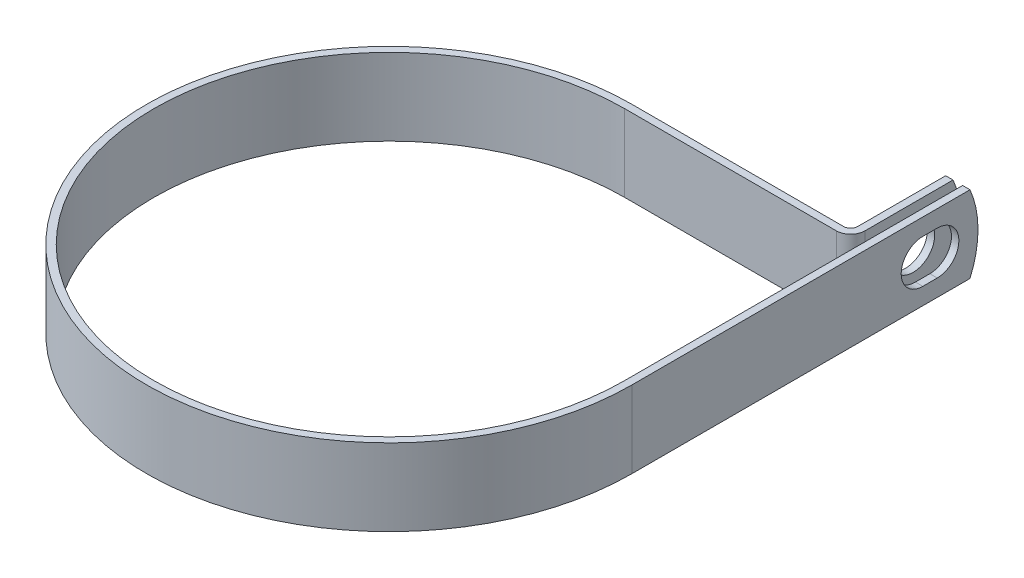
ISO-10303-21;
HEADER;
FILE_DESCRIPTION(('STEP AP214'),'2;1');
FILE_NAME('part.step','',(''),(''),'','','');
FILE_SCHEMA(('AUTOMOTIVE_DESIGN { 1 0 10303 214 1 1 1 1 }'));
ENDSEC;
DATA;
#1=APPLICATION_CONTEXT('core data for automotive mechanical design processes');
#2=APPLICATION_PROTOCOL_DEFINITION('international standard','automotive_design',2000,#1);
#3=PRODUCT_CONTEXT('',#1,'mechanical');
#4=PRODUCT('Part','Part','',(#3));
#5=PRODUCT_RELATED_PRODUCT_CATEGORY('part','',(#4));
#6=PRODUCT_DEFINITION_FORMATION('','',#4);
#7=PRODUCT_DEFINITION_CONTEXT('part definition',#1,'design');
#8=PRODUCT_DEFINITION('design','',#6,#7);
#9=PRODUCT_DEFINITION_SHAPE('','',#8);
#10=(LENGTH_UNIT() NAMED_UNIT(*) SI_UNIT(.MILLI.,.METRE.));
#11=(NAMED_UNIT(*) PLANE_ANGLE_UNIT() SI_UNIT($,.RADIAN.));
#12=(NAMED_UNIT(*) SI_UNIT($,.STERADIAN.) SOLID_ANGLE_UNIT());
#13=UNCERTAINTY_MEASURE_WITH_UNIT(LENGTH_MEASURE(1.E-05),#10,'distance_accuracy_value','');
#14=(GEOMETRIC_REPRESENTATION_CONTEXT(3) GLOBAL_UNCERTAINTY_ASSIGNED_CONTEXT((#13)) GLOBAL_UNIT_ASSIGNED_CONTEXT((#10,
#11,#12)) REPRESENTATION_CONTEXT('',''));
#15=CARTESIAN_POINT('',(0.,0.,0.));
#16=DIRECTION('',(0.,0.,1.));
#17=DIRECTION('',(1.,0.,0.));
#18=AXIS2_PLACEMENT_3D('',#15,#16,#17);
#19=CARTESIAN_POINT('',(38.8874,6.35,0.));
#20=DIRECTION('',(-1.,0.,0.));
#21=DIRECTION('',(0.,0.,1.));
#22=AXIS2_PLACEMENT_3D('',#19,#20,#21);
#23=PLANE('',#22);
#24=DIRECTION('',(0.,0.,-1.));
#25=VECTOR('',#24,1.);
#26=CARTESIAN_POINT('',(38.8874,-3.5687,-48.0059999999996));
#27=LINE('',#26,#25);
#28=CARTESIAN_POINT('',(38.8874,-3.5687,-48.0059999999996));
#29=VERTEX_POINT('',#28);
#30=CARTESIAN_POINT('',(38.8874,-3.5687,-50.3936000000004));
#31=VERTEX_POINT('',#30);
#32=EDGE_CURVE('E236',#29,#31,#27,.T.);
#33=ORIENTED_EDGE('',*,*,#32,.T.);
#34=CARTESIAN_POINT('',(38.8874,0.,-50.3935999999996));
#35=DIRECTION('',(-1.,0.,0.));
#36=DIRECTION('',(0.,0.,1.));
#37=AXIS2_PLACEMENT_3D('',#34,#35,#36);
#38=CIRCLE('',#37,3.5687);
#39=CARTESIAN_POINT('',(38.8874,3.5687,-50.3936000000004));
#40=VERTEX_POINT('',#39);
#41=EDGE_CURVE('E257',#31,#40,#38,.F.);
#42=ORIENTED_EDGE('',*,*,#41,.T.);
#43=DIRECTION('',(0.,0.,1.));
#44=VECTOR('',#43,1.);
#45=CARTESIAN_POINT('',(38.8874,3.5687,-48.0059999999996));
#46=LINE('',#45,#44);
#47=CARTESIAN_POINT('',(38.8874,3.5687,-48.0059999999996));
#48=VERTEX_POINT('',#47);
#49=EDGE_CURVE('E253',#40,#48,#46,.T.);
#50=ORIENTED_EDGE('',*,*,#49,.T.);
#51=CARTESIAN_POINT('',(38.8874,0.,-48.0059999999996));
#52=DIRECTION('',(-1.,0.,0.));
#53=DIRECTION('',(0.,0.,1.));
#54=AXIS2_PLACEMENT_3D('',#51,#52,#53);
#55=CIRCLE('',#54,3.5687);
#56=EDGE_CURVE('E248',#48,#29,#55,.F.);
#57=ORIENTED_EDGE('',*,*,#56,.T.);
#58=EDGE_LOOP('',(#33,#42,#50,#57));
#59=FACE_BOUND('',#58,.T.);
#60=CARTESIAN_POINT('',(38.8874,0.,-41.2496));
#61=DIRECTION('',(-1.,0.,0.));
#62=DIRECTION('',(0.,0.,1.));
#63=AXIS2_PLACEMENT_3D('',#60,#61,#62);
#64=CIRCLE('',#63,15.875);
#65=CARTESIAN_POINT('',(38.8874,6.35,-55.7992778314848));
#66=VERTEX_POINT('',#65);
#67=CARTESIAN_POINT('',(38.8874,-6.35,-55.7992778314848));
#68=VERTEX_POINT('',#67);
#69=EDGE_CURVE('E75',#66,#68,#64,.T.);
#70=ORIENTED_EDGE('',*,*,#69,.T.);
#71=DIRECTION('',(0.,0.,-1.));
#72=VECTOR('',#71,1.);
#73=CARTESIAN_POINT('',(38.8874,-6.35,0.));
#74=LINE('',#73,#72);
#75=CARTESIAN_POINT('',(38.8874,-6.35,0.));
#76=VERTEX_POINT('',#75);
#77=EDGE_CURVE('E271',#76,#68,#74,.T.);
#78=ORIENTED_EDGE('',*,*,#77,.F.);
#79=DIRECTION('',(0.,-1.,0.));
#80=VECTOR('',#79,1.);
#81=CARTESIAN_POINT('',(38.8874,6.35,0.));
#82=LINE('',#81,#80);
#83=CARTESIAN_POINT('',(38.8874,6.35,0.));
#84=VERTEX_POINT('',#83);
#85=EDGE_CURVE('E218',#84,#76,#82,.T.);
#86=ORIENTED_EDGE('',*,*,#85,.F.);
#87=DIRECTION('',(0.,0.,-1.));
#88=VECTOR('',#87,1.);
#89=CARTESIAN_POINT('',(38.8874,6.35,-38.8874));
#90=LINE('',#89,#88);
#91=EDGE_CURVE('E273',#84,#66,#90,.T.);
#92=ORIENTED_EDGE('',*,*,#91,.T.);
#93=EDGE_LOOP('',(#70,#78,#86,#92));
#94=FACE_BOUND('',#93,.T.);
#95=ADVANCED_FACE('F54',(#59,#94),#23,.T.);
#96=CARTESIAN_POINT('',(37.3126,6.35,-57.1246));
#97=DIRECTION('',(1.,0.,0.));
#98=DIRECTION('',(0.,0.,-1.));
#99=AXIS2_PLACEMENT_3D('',#96,#97,#98);
#100=PLANE('',#99);
#101=CARTESIAN_POINT('',(37.3126,0.,-49.1998));
#102=DIRECTION('',(1.,0.,0.));
#103=DIRECTION('',(0.,0.,-1.));
#104=AXIS2_PLACEMENT_3D('',#101,#102,#103);
#105=CIRCLE('',#104,3.5687);
#106=CARTESIAN_POINT('',(37.3126,0.,-52.7685));
#107=VERTEX_POINT('',#106);
#108=EDGE_CURVE('E268',#107,#107,#105,.F.);
#109=ORIENTED_EDGE('',*,*,#108,.T.);
#110=EDGE_LOOP('',(#109));
#111=FACE_BOUND('',#110,.T.);
#112=DIRECTION('',(0.,0.,1.));
#113=VECTOR('',#112,1.);
#114=CARTESIAN_POINT('',(37.3126,-6.35,-57.1246));
#115=LINE('',#114,#113);
#116=CARTESIAN_POINT('',(37.3126,-6.35,-55.7992778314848));
#117=VERTEX_POINT('',#116);
#118=CARTESIAN_POINT('',(37.3126,-6.35,-41.26484));
#119=VERTEX_POINT('',#118);
#120=EDGE_CURVE('E184',#117,#119,#115,.T.);
#121=ORIENTED_EDGE('',*,*,#120,.F.);
#122=CARTESIAN_POINT('',(37.3126,0.,-41.2496));
#123=DIRECTION('',(1.,0.,0.));
#124=DIRECTION('',(0.,0.,-1.));
#125=AXIS2_PLACEMENT_3D('',#122,#123,#124);
#126=CIRCLE('',#125,15.875);
#127=CARTESIAN_POINT('',(37.3126,6.35,-55.7992778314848));
#128=VERTEX_POINT('',#127);
#129=EDGE_CURVE('E176',#117,#128,#126,.T.);
#130=ORIENTED_EDGE('',*,*,#129,.T.);
#131=DIRECTION('',(0.,0.,1.));
#132=VECTOR('',#131,1.);
#133=CARTESIAN_POINT('',(37.3126,6.35,-57.1246));
#134=LINE('',#133,#132);
#135=CARTESIAN_POINT('',(37.3126,6.35,-41.26484));
#136=VERTEX_POINT('',#135);
#137=EDGE_CURVE('E224',#128,#136,#134,.T.);
#138=ORIENTED_EDGE('',*,*,#137,.T.);
#139=DIRECTION('',(0.,-1.,0.));
#140=VECTOR('',#139,1.);
#141=CARTESIAN_POINT('',(37.3126,6.35,-41.26484));
#142=LINE('',#141,#140);
#143=EDGE_CURVE('E211',#136,#119,#142,.T.);
#144=ORIENTED_EDGE('',*,*,#143,.T.);
#145=EDGE_LOOP('',(#121,#130,#138,#144));
#146=FACE_BOUND('',#145,.T.);
#147=ADVANCED_FACE('F226',(#111,#146),#100,.T.);
#148=CARTESIAN_POINT('',(36.0934,6.35,-57.1246));
#149=DIRECTION('',(1.,0.,0.));
#150=DIRECTION('',(0.,0.,-1.));
#151=AXIS2_PLACEMENT_3D('',#148,#149,#150);
#152=PLANE('',#151);
#153=CARTESIAN_POINT('',(36.0934,0.,-49.1998));
#154=DIRECTION('',(-1.,0.,0.));
#155=DIRECTION('',(0.,0.,1.));
#156=AXIS2_PLACEMENT_3D('',#153,#154,#155);
#157=CIRCLE('',#156,3.5687);
#158=CARTESIAN_POINT('',(36.0934,0.,-45.6311));
#159=VERTEX_POINT('',#158);
#160=EDGE_CURVE('E265',#159,#159,#157,.T.);
#161=ORIENTED_EDGE('',*,*,#160,.F.);
#162=EDGE_LOOP('',(#161));
#163=FACE_BOUND('',#162,.T.);
#164=CARTESIAN_POINT('',(36.0934,0.,-41.2496));
#165=DIRECTION('',(-1.,0.,0.));
#166=DIRECTION('',(0.,0.,1.));
#167=AXIS2_PLACEMENT_3D('',#164,#165,#166);
#168=CIRCLE('',#167,15.875);
#169=CARTESIAN_POINT('',(36.0934,6.35,-55.7992778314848));
#170=VERTEX_POINT('',#169);
#171=CARTESIAN_POINT('',(36.0934,-6.35,-55.7992778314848));
#172=VERTEX_POINT('',#171);
#173=EDGE_CURVE('E67',#170,#172,#168,.T.);
#174=ORIENTED_EDGE('',*,*,#173,.T.);
#175=DIRECTION('',(0.,0.,1.));
#176=VECTOR('',#175,1.);
#177=CARTESIAN_POINT('',(36.0934,-6.35,-57.1246));
#178=LINE('',#177,#176);
#179=CARTESIAN_POINT('',(36.0934,-6.35,-41.26484));
#180=VERTEX_POINT('',#179);
#181=EDGE_CURVE('E167',#172,#180,#178,.T.);
#182=ORIENTED_EDGE('',*,*,#181,.T.);
#183=DIRECTION('',(0.,-1.,0.));
#184=VECTOR('',#183,1.);
#185=CARTESIAN_POINT('',(36.0934,6.35,-41.26484));
#186=LINE('',#185,#184);
#187=CARTESIAN_POINT('',(36.0934,6.35,-41.26484));
#188=VERTEX_POINT('',#187);
#189=EDGE_CURVE('E209',#188,#180,#186,.T.);
#190=ORIENTED_EDGE('',*,*,#189,.F.);
#191=DIRECTION('',(0.,0.,1.));
#192=VECTOR('',#191,1.);
#193=CARTESIAN_POINT('',(36.0934,6.35,-57.1246));
#194=LINE('',#193,#192);
#195=EDGE_CURVE('E169',#170,#188,#194,.T.);
#196=ORIENTED_EDGE('',*,*,#195,.F.);
#197=EDGE_LOOP('',(#174,#182,#190,#196));
#198=FACE_BOUND('',#197,.T.);
#199=ADVANCED_FACE('F164',(#163,#198),#152,.F.);
#200=CARTESIAN_POINT('',(40.1066,6.35,0.));
#201=DIRECTION('',(-1.,0.,0.));
#202=DIRECTION('',(0.,0.,1.));
#203=AXIS2_PLACEMENT_3D('',#200,#201,#202);
#204=PLANE('',#203);
#205=CARTESIAN_POINT('',(40.1066,0.,-50.3935999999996));
#206=DIRECTION('',(1.,0.,0.));
#207=DIRECTION('',(0.,0.,-1.));
#208=AXIS2_PLACEMENT_3D('',#205,#206,#207);
#209=CIRCLE('',#208,3.5687);
#210=CARTESIAN_POINT('',(40.1066,-3.5687,-50.3936000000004));
#211=VERTEX_POINT('',#210);
#212=CARTESIAN_POINT('',(40.1066,3.5687,-50.3936000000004));
#213=VERTEX_POINT('',#212);
#214=EDGE_CURVE('E237',#211,#213,#209,.T.);
#215=ORIENTED_EDGE('',*,*,#214,.F.);
#216=DIRECTION('',(0.,0.,-1.));
#217=VECTOR('',#216,1.);
#218=CARTESIAN_POINT('',(40.1066,-3.5687,-48.0059999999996));
#219=LINE('',#218,#217);
#220=CARTESIAN_POINT('',(40.1066,-3.5687,-48.0059999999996));
#221=VERTEX_POINT('',#220);
#222=EDGE_CURVE('E240',#221,#211,#219,.T.);
#223=ORIENTED_EDGE('',*,*,#222,.F.);
#224=CARTESIAN_POINT('',(40.1066,0.,-48.0059999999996));
#225=DIRECTION('',(1.,0.,0.));
#226=DIRECTION('',(0.,0.,-1.));
#227=AXIS2_PLACEMENT_3D('',#224,#225,#226);
#228=CIRCLE('',#227,3.5687);
#229=CARTESIAN_POINT('',(40.1066,3.5687,-48.0059999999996));
#230=VERTEX_POINT('',#229);
#231=EDGE_CURVE('E230',#230,#221,#228,.T.);
#232=ORIENTED_EDGE('',*,*,#231,.F.);
#233=DIRECTION('',(0.,0.,1.));
#234=VECTOR('',#233,1.);
#235=CARTESIAN_POINT('',(40.1066,3.5687,-48.0059999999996));
#236=LINE('',#235,#234);
#237=EDGE_CURVE('E234',#213,#230,#236,.T.);
#238=ORIENTED_EDGE('',*,*,#237,.F.);
#239=EDGE_LOOP('',(#215,#223,#232,#238));
#240=FACE_BOUND('',#239,.T.);
#241=DIRECTION('',(0.,0.,-1.));
#242=VECTOR('',#241,1.);
#243=CARTESIAN_POINT('',(40.1066,-6.35,0.));
#244=LINE('',#243,#242);
#245=CARTESIAN_POINT('',(40.1066,-6.35,0.));
#246=VERTEX_POINT('',#245);
#247=CARTESIAN_POINT('',(40.1066,-6.35,-55.7992778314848));
#248=VERTEX_POINT('',#247);
#249=EDGE_CURVE('E195',#246,#248,#244,.T.);
#250=ORIENTED_EDGE('',*,*,#249,.T.);
#251=CARTESIAN_POINT('',(40.1066,0.,-41.2496));
#252=DIRECTION('',(-1.,0.,0.));
#253=DIRECTION('',(0.,0.,1.));
#254=AXIS2_PLACEMENT_3D('',#251,#252,#253);
#255=CIRCLE('',#254,15.875);
#256=CARTESIAN_POINT('',(40.1066,6.35,-55.7992778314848));
#257=VERTEX_POINT('',#256);
#258=EDGE_CURVE('E170',#257,#248,#255,.T.);
#259=ORIENTED_EDGE('',*,*,#258,.F.);
#260=DIRECTION('',(0.,0.,-1.));
#261=VECTOR('',#260,1.);
#262=CARTESIAN_POINT('',(40.1066,6.35,-38.8874));
#263=LINE('',#262,#261);
#264=CARTESIAN_POINT('',(40.1066,6.35,0.));
#265=VERTEX_POINT('',#264);
#266=EDGE_CURVE('E198',#265,#257,#263,.T.);
#267=ORIENTED_EDGE('',*,*,#266,.F.);
#268=DIRECTION('',(0.,-1.,0.));
#269=VECTOR('',#268,1.);
#270=CARTESIAN_POINT('',(40.1066,6.35,0.));
#271=LINE('',#270,#269);
#272=EDGE_CURVE('E199',#265,#246,#271,.T.);
#273=ORIENTED_EDGE('',*,*,#272,.T.);
#274=EDGE_LOOP('',(#250,#259,#267,#273));
#275=FACE_BOUND('',#274,.T.);
#276=ADVANCED_FACE('F321',(#240,#275),#204,.F.);
#277=CARTESIAN_POINT('',(0.,-6.35,0.));
#278=DIRECTION('',(0.,1.,0.));
#279=DIRECTION('',(1.,0.,0.));
#280=AXIS2_PLACEMENT_3D('',#277,#278,#279);
#281=PLANE('',#280);
#282=DIRECTION('',(-1.,0.,0.));
#283=VECTOR('',#282,1.);
#284=CARTESIAN_POINT('',(40.1066,-6.35,-55.7992778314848));
#285=LINE('',#284,#283);
#286=EDGE_CURVE('E171',#248,#68,#285,.T.);
#287=ORIENTED_EDGE('',*,*,#286,.F.);
#288=ORIENTED_EDGE('',*,*,#249,.F.);
#289=CARTESIAN_POINT('',(0.,-6.35,0.));
#290=DIRECTION('',(0.,1.,0.));
#291=DIRECTION('',(1.,0.,0.));
#292=AXIS2_PLACEMENT_3D('',#289,#290,#291);
#293=CIRCLE('',#292,40.1066);
#294=CARTESIAN_POINT('',(0.,-6.35,-40.1066));
#295=VERTEX_POINT('',#294);
#296=EDGE_CURVE('E193',#295,#246,#293,.T.);
#297=ORIENTED_EDGE('',*,*,#296,.F.);
#298=DIRECTION('',(1.,0.,0.));
#299=VECTOR('',#298,1.);
#300=CARTESIAN_POINT('',(0.,-6.35,-40.1066));
#301=LINE('',#300,#299);
#302=CARTESIAN_POINT('',(34.93516,-6.35,-40.1066));
#303=VERTEX_POINT('',#302);
#304=EDGE_CURVE('E186',#303,#295,#301,.F.);
#305=ORIENTED_EDGE('',*,*,#304,.F.);
#306=CARTESIAN_POINT('',(34.93516,-6.35,-41.26484));
#307=DIRECTION('',(0.,1.,0.));
#308=DIRECTION('',(1.,0.,0.));
#309=AXIS2_PLACEMENT_3D('',#306,#307,#308);
#310=CIRCLE('',#309,1.15824000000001);
#311=EDGE_CURVE('E183',#180,#303,#310,.F.);
#312=ORIENTED_EDGE('',*,*,#311,.F.);
#313=ORIENTED_EDGE('',*,*,#181,.F.);
#314=DIRECTION('',(-1.,0.,0.));
#315=VECTOR('',#314,1.);
#316=CARTESIAN_POINT('',(40.1066,-6.35,-55.7992778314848));
#317=LINE('',#316,#315);
#318=EDGE_CURVE('E12',#117,#172,#317,.T.);
#319=ORIENTED_EDGE('',*,*,#318,.F.);
#320=ORIENTED_EDGE('',*,*,#120,.T.);
#321=CARTESIAN_POINT('',(34.93516,-6.35,-41.26484));
#322=DIRECTION('',(0.,-1.,0.));
#323=DIRECTION('',(0.,0.,1.));
#324=AXIS2_PLACEMENT_3D('',#321,#322,#323);
#325=CIRCLE('',#324,2.37744);
#326=CARTESIAN_POINT('',(34.93516,-6.35,-38.8874));
#327=VERTEX_POINT('',#326);
#328=EDGE_CURVE('E188',#119,#327,#325,.T.);
#329=ORIENTED_EDGE('',*,*,#328,.T.);
#330=DIRECTION('',(-1.,0.,0.));
#331=VECTOR('',#330,1.);
#332=CARTESIAN_POINT('',(0.,-6.35,-38.8874));
#333=LINE('',#332,#331);
#334=CARTESIAN_POINT('',(0.,-6.35,-38.8874));
#335=VERTEX_POINT('',#334);
#336=EDGE_CURVE('E298',#327,#335,#333,.T.);
#337=ORIENTED_EDGE('',*,*,#336,.T.);
#338=CARTESIAN_POINT('',(0.,-6.35,0.));
#339=DIRECTION('',(0.,1.,0.));
#340=DIRECTION('',(0.,0.,1.));
#341=AXIS2_PLACEMENT_3D('',#338,#339,#340);
#342=CIRCLE('',#341,38.8874);
#343=EDGE_CURVE('E295',#335,#76,#342,.T.);
#344=ORIENTED_EDGE('',*,*,#343,.T.);
#345=ORIENTED_EDGE('',*,*,#77,.T.);
#346=EDGE_LOOP('',(#287,#288,#297,#305,#312,#313,#319,#320,#329,#337,#344,#345));
#347=FACE_BOUND('',#346,.T.);
#348=ADVANCED_FACE('F181',(#347),#281,.F.);
#349=CARTESIAN_POINT('',(0.,6.35,0.));
#350=DIRECTION('',(0.,1.,0.));
#351=DIRECTION('',(1.,0.,0.));
#352=AXIS2_PLACEMENT_3D('',#349,#350,#351);
#353=PLANE('',#352);
#354=ORIENTED_EDGE('',*,*,#266,.T.);
#355=DIRECTION('',(-1.,0.,0.));
#356=VECTOR('',#355,1.);
#357=CARTESIAN_POINT('',(40.1066,6.35,-55.7992778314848));
#358=LINE('',#357,#356);
#359=EDGE_CURVE('E228',#257,#66,#358,.T.);
#360=ORIENTED_EDGE('',*,*,#359,.T.);
#361=ORIENTED_EDGE('',*,*,#91,.F.);
#362=CARTESIAN_POINT('',(0.,6.35,0.));
#363=DIRECTION('',(0.,1.,0.));
#364=DIRECTION('',(0.,0.,1.));
#365=AXIS2_PLACEMENT_3D('',#362,#363,#364);
#366=CIRCLE('',#365,38.8874);
#367=CARTESIAN_POINT('',(0.,6.35,-38.8874));
#368=VERTEX_POINT('',#367);
#369=EDGE_CURVE('E276',#368,#84,#366,.T.);
#370=ORIENTED_EDGE('',*,*,#369,.F.);
#371=DIRECTION('',(-1.,0.,0.));
#372=VECTOR('',#371,1.);
#373=CARTESIAN_POINT('',(0.,6.35,-38.8874));
#374=LINE('',#373,#372);
#375=CARTESIAN_POINT('',(34.93516,6.35,-38.8874));
#376=VERTEX_POINT('',#375);
#377=EDGE_CURVE('E279',#376,#368,#374,.T.);
#378=ORIENTED_EDGE('',*,*,#377,.F.);
#379=CARTESIAN_POINT('',(34.93516,6.35,-41.26484));
#380=DIRECTION('',(0.,-1.,0.));
#381=DIRECTION('',(0.,0.,1.));
#382=AXIS2_PLACEMENT_3D('',#379,#380,#381);
#383=CIRCLE('',#382,2.37744);
#384=EDGE_CURVE('E282',#136,#376,#383,.T.);
#385=ORIENTED_EDGE('',*,*,#384,.F.);
#386=ORIENTED_EDGE('',*,*,#137,.F.);
#387=DIRECTION('',(-1.,0.,0.));
#388=VECTOR('',#387,1.);
#389=CARTESIAN_POINT('',(40.1066,6.35,-55.7992778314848));
#390=LINE('',#389,#388);
#391=EDGE_CURVE('E61',#128,#170,#390,.T.);
#392=ORIENTED_EDGE('',*,*,#391,.T.);
#393=ORIENTED_EDGE('',*,*,#195,.T.);
#394=CARTESIAN_POINT('',(34.93516,6.35,-41.26484));
#395=DIRECTION('',(0.,1.,0.));
#396=DIRECTION('',(1.,0.,0.));
#397=AXIS2_PLACEMENT_3D('',#394,#395,#396);
#398=CIRCLE('',#397,1.15824000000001);
#399=CARTESIAN_POINT('',(34.93516,6.35,-40.1066));
#400=VERTEX_POINT('',#399);
#401=EDGE_CURVE('E287',#188,#400,#398,.F.);
#402=ORIENTED_EDGE('',*,*,#401,.T.);
#403=DIRECTION('',(1.,0.,0.));
#404=VECTOR('',#403,1.);
#405=CARTESIAN_POINT('',(0.,6.35,-40.1066));
#406=LINE('',#405,#404);
#407=CARTESIAN_POINT('',(0.,6.35,-40.1066));
#408=VERTEX_POINT('',#407);
#409=EDGE_CURVE('E289',#400,#408,#406,.F.);
#410=ORIENTED_EDGE('',*,*,#409,.T.);
#411=CARTESIAN_POINT('',(0.,6.35,0.));
#412=DIRECTION('',(0.,1.,0.));
#413=DIRECTION('',(1.,0.,0.));
#414=AXIS2_PLACEMENT_3D('',#411,#412,#413);
#415=CIRCLE('',#414,40.1066);
#416=EDGE_CURVE('E203',#408,#265,#415,.T.);
#417=ORIENTED_EDGE('',*,*,#416,.T.);
#418=EDGE_LOOP('',(#354,#360,#361,#370,#378,#385,#386,#392,#393,#402,#410,#417));
#419=FACE_BOUND('',#418,.T.);
#420=ADVANCED_FACE('F222',(#419),#353,.T.);
#421=CARTESIAN_POINT('',(0.,6.35,0.));
#422=DIRECTION('',(0.,-1.,0.));
#423=DIRECTION('',(0.,0.,-1.));
#424=AXIS2_PLACEMENT_3D('',#421,#422,#423);
#425=CYLINDRICAL_SURFACE('',#424,38.8874);
#426=ORIENTED_EDGE('',*,*,#343,.F.);
#427=DIRECTION('',(0.,-1.,0.));
#428=VECTOR('',#427,1.);
#429=CARTESIAN_POINT('',(0.,6.35,-38.8874));
#430=LINE('',#429,#428);
#431=EDGE_CURVE('E216',#368,#335,#430,.T.);
#432=ORIENTED_EDGE('',*,*,#431,.F.);
#433=ORIENTED_EDGE('',*,*,#369,.T.);
#434=ORIENTED_EDGE('',*,*,#85,.T.);
#435=EDGE_LOOP('',(#426,#432,#433,#434));
#436=FACE_BOUND('',#435,.T.);
#437=ADVANCED_FACE('F311',(#436),#425,.F.);
#438=CARTESIAN_POINT('',(0.,6.35,-38.8874));
#439=DIRECTION('',(0.,0.,1.));
#440=DIRECTION('',(1.,0.,0.));
#441=AXIS2_PLACEMENT_3D('',#438,#439,#440);
#442=PLANE('',#441);
#443=ORIENTED_EDGE('',*,*,#336,.F.);
#444=DIRECTION('',(0.,-1.,0.));
#445=VECTOR('',#444,1.);
#446=CARTESIAN_POINT('',(34.93516,6.35,-38.8874));
#447=LINE('',#446,#445);
#448=EDGE_CURVE('E214',#376,#327,#447,.T.);
#449=ORIENTED_EDGE('',*,*,#448,.F.);
#450=ORIENTED_EDGE('',*,*,#377,.T.);
#451=ORIENTED_EDGE('',*,*,#431,.T.);
#452=EDGE_LOOP('',(#443,#449,#450,#451));
#453=FACE_BOUND('',#452,.T.);
#454=ADVANCED_FACE('F307',(#453),#442,.T.);
#455=CARTESIAN_POINT('',(34.93516,6.35,-41.26484));
#456=DIRECTION('',(0.,-1.,0.));
#457=DIRECTION('',(0.,0.,-1.));
#458=AXIS2_PLACEMENT_3D('',#455,#456,#457);
#459=CYLINDRICAL_SURFACE('',#458,2.37744);
#460=ORIENTED_EDGE('',*,*,#328,.F.);
#461=ORIENTED_EDGE('',*,*,#143,.F.);
#462=ORIENTED_EDGE('',*,*,#384,.T.);
#463=ORIENTED_EDGE('',*,*,#448,.T.);
#464=EDGE_LOOP('',(#460,#461,#462,#463));
#465=FACE_BOUND('',#464,.T.);
#466=ADVANCED_FACE('F304',(#465),#459,.T.);
#467=CARTESIAN_POINT('',(34.93516,6.35,-41.26484));
#468=DIRECTION('',(0.,-1.,0.));
#469=DIRECTION('',(0.,0.,-1.));
#470=AXIS2_PLACEMENT_3D('',#467,#468,#469);
#471=CYLINDRICAL_SURFACE('',#470,1.15824000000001);
#472=ORIENTED_EDGE('',*,*,#311,.T.);
#473=DIRECTION('',(0.,-1.,0.));
#474=VECTOR('',#473,1.);
#475=CARTESIAN_POINT('',(34.93516,6.35,-40.1066));
#476=LINE('',#475,#474);
#477=EDGE_CURVE('E206',#400,#303,#476,.T.);
#478=ORIENTED_EDGE('',*,*,#477,.F.);
#479=ORIENTED_EDGE('',*,*,#401,.F.);
#480=ORIENTED_EDGE('',*,*,#189,.T.);
#481=EDGE_LOOP('',(#472,#478,#479,#480));
#482=FACE_BOUND('',#481,.T.);
#483=ADVANCED_FACE('F334',(#482),#471,.F.);
#484=CARTESIAN_POINT('',(0.,6.35,-40.1066));
#485=DIRECTION('',(0.,0.,1.));
#486=DIRECTION('',(1.,0.,0.));
#487=AXIS2_PLACEMENT_3D('',#484,#485,#486);
#488=PLANE('',#487);
#489=ORIENTED_EDGE('',*,*,#304,.T.);
#490=DIRECTION('',(0.,-1.,0.));
#491=VECTOR('',#490,1.);
#492=CARTESIAN_POINT('',(0.,6.35,-40.1066));
#493=LINE('',#492,#491);
#494=EDGE_CURVE('E202',#408,#295,#493,.T.);
#495=ORIENTED_EDGE('',*,*,#494,.F.);
#496=ORIENTED_EDGE('',*,*,#409,.F.);
#497=ORIENTED_EDGE('',*,*,#477,.T.);
#498=EDGE_LOOP('',(#489,#495,#496,#497));
#499=FACE_BOUND('',#498,.T.);
#500=ADVANCED_FACE('F330',(#499),#488,.F.);
#501=CARTESIAN_POINT('',(0.,6.35,0.));
#502=DIRECTION('',(0.,-1.,0.));
#503=DIRECTION('',(0.,0.,-1.));
#504=AXIS2_PLACEMENT_3D('',#501,#502,#503);
#505=CYLINDRICAL_SURFACE('',#504,40.1066);
#506=ORIENTED_EDGE('',*,*,#296,.T.);
#507=ORIENTED_EDGE('',*,*,#272,.F.);
#508=ORIENTED_EDGE('',*,*,#416,.F.);
#509=ORIENTED_EDGE('',*,*,#494,.T.);
#510=EDGE_LOOP('',(#506,#507,#508,#509));
#511=FACE_BOUND('',#510,.T.);
#512=ADVANCED_FACE('F327',(#511),#505,.T.);
#513=CARTESIAN_POINT('',(47.4064078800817,0.,-49.1998));
#514=DIRECTION('',(-1.,0.,0.));
#515=DIRECTION('',(0.,0.,1.));
#516=AXIS2_PLACEMENT_3D('',#513,#514,#515);
#517=CYLINDRICAL_SURFACE('',#516,3.5687);
#518=ORIENTED_EDGE('',*,*,#160,.T.);
#519=EDGE_LOOP('',(#518));
#520=FACE_BOUND('',#519,.T.);
#521=ORIENTED_EDGE('',*,*,#108,.F.);
#522=EDGE_LOOP('',(#521));
#523=FACE_BOUND('',#522,.T.);
#524=ADVANCED_FACE('F379',(#520,#523),#517,.F.);
#525=CARTESIAN_POINT('',(26.9849589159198,-3.5687,-48.0059999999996));
#526=DIRECTION('',(0.,-1.,0.));
#527=DIRECTION('',(0.,0.,-1.));
#528=AXIS2_PLACEMENT_3D('',#525,#526,#527);
#529=PLANE('',#528);
#530=DIRECTION('',(1.,0.,0.));
#531=VECTOR('',#530,1.);
#532=CARTESIAN_POINT('',(26.9849589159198,-3.5687,-48.0059999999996));
#533=LINE('',#532,#531);
#534=EDGE_CURVE('E251',#29,#221,#533,.T.);
#535=ORIENTED_EDGE('',*,*,#534,.T.);
#536=ORIENTED_EDGE('',*,*,#222,.T.);
#537=DIRECTION('',(1.,0.,0.));
#538=VECTOR('',#537,1.);
#539=CARTESIAN_POINT('',(26.9849589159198,-3.5687,-50.3936000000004));
#540=LINE('',#539,#538);
#541=EDGE_CURVE('E247',#31,#211,#540,.T.);
#542=ORIENTED_EDGE('',*,*,#541,.F.);
#543=ORIENTED_EDGE('',*,*,#32,.F.);
#544=EDGE_LOOP('',(#535,#536,#542,#543));
#545=FACE_BOUND('',#544,.T.);
#546=ADVANCED_FACE('F354',(#545),#529,.F.);
#547=CARTESIAN_POINT('',(26.9849589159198,0.,-50.3935999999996));
#548=DIRECTION('',(1.,0.,0.));
#549=DIRECTION('',(0.,0.,-1.));
#550=AXIS2_PLACEMENT_3D('',#547,#548,#549);
#551=CYLINDRICAL_SURFACE('',#550,3.5687);
#552=ORIENTED_EDGE('',*,*,#541,.T.);
#553=ORIENTED_EDGE('',*,*,#214,.T.);
#554=DIRECTION('',(1.,0.,0.));
#555=VECTOR('',#554,1.);
#556=CARTESIAN_POINT('',(26.9849589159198,3.5687,-50.3936000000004));
#557=LINE('',#556,#555);
#558=EDGE_CURVE('E256',#40,#213,#557,.T.);
#559=ORIENTED_EDGE('',*,*,#558,.F.);
#560=ORIENTED_EDGE('',*,*,#41,.F.);
#561=EDGE_LOOP('',(#552,#553,#559,#560));
#562=FACE_BOUND('',#561,.T.);
#563=ADVANCED_FACE('F358',(#562),#551,.F.);
#564=CARTESIAN_POINT('',(26.9849589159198,3.5687,-48.0059999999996));
#565=DIRECTION('',(0.,1.,0.));
#566=DIRECTION('',(0.,0.,1.));
#567=AXIS2_PLACEMENT_3D('',#564,#565,#566);
#568=PLANE('',#567);
#569=ORIENTED_EDGE('',*,*,#558,.T.);
#570=ORIENTED_EDGE('',*,*,#237,.T.);
#571=DIRECTION('',(1.,0.,0.));
#572=VECTOR('',#571,1.);
#573=CARTESIAN_POINT('',(26.9849589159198,3.5687,-48.0059999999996));
#574=LINE('',#573,#572);
#575=EDGE_CURVE('E252',#48,#230,#574,.T.);
#576=ORIENTED_EDGE('',*,*,#575,.F.);
#577=ORIENTED_EDGE('',*,*,#49,.F.);
#578=EDGE_LOOP('',(#569,#570,#576,#577));
#579=FACE_BOUND('',#578,.T.);
#580=ADVANCED_FACE('F362',(#579),#568,.F.);
#581=CARTESIAN_POINT('',(26.9849589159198,0.,-48.0059999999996));
#582=DIRECTION('',(1.,0.,0.));
#583=DIRECTION('',(0.,0.,-1.));
#584=AXIS2_PLACEMENT_3D('',#581,#582,#583);
#585=CYLINDRICAL_SURFACE('',#584,3.5687);
#586=ORIENTED_EDGE('',*,*,#575,.T.);
#587=ORIENTED_EDGE('',*,*,#231,.T.);
#588=ORIENTED_EDGE('',*,*,#534,.F.);
#589=ORIENTED_EDGE('',*,*,#56,.F.);
#590=EDGE_LOOP('',(#586,#587,#588,#589));
#591=FACE_BOUND('',#590,.T.);
#592=ADVANCED_FACE('F366',(#591),#585,.F.);
#593=CARTESIAN_POINT('',(40.1066,0.,-41.2496));
#594=DIRECTION('',(-1.,0.,0.));
#595=DIRECTION('',(0.,0.,1.));
#596=AXIS2_PLACEMENT_3D('',#593,#594,#595);
#597=CYLINDRICAL_SURFACE('',#596,15.875);
#598=ORIENTED_EDGE('',*,*,#129,.F.);
#599=ORIENTED_EDGE('',*,*,#318,.T.);
#600=ORIENTED_EDGE('',*,*,#173,.F.);
#601=ORIENTED_EDGE('',*,*,#391,.F.);
#602=EDGE_LOOP('',(#598,#599,#600,#601));
#603=FACE_BOUND('',#602,.T.);
#604=ADVANCED_FACE('F174',(#603),#597,.T.);
#605=ORIENTED_EDGE('',*,*,#359,.F.);
#606=ORIENTED_EDGE('',*,*,#258,.T.);
#607=ORIENTED_EDGE('',*,*,#286,.T.);
#608=ORIENTED_EDGE('',*,*,#69,.F.);
#609=EDGE_LOOP('',(#605,#606,#607,#608));
#610=FACE_BOUND('',#609,.T.);
#611=ADVANCED_FACE('F316',(#610),#597,.T.);
#612=CLOSED_SHELL('',(#95,#147,#199,#276,#348,#420,#437,#454,#466,#483,#500,#512,#524,#546,#563,
#580,#592,#604,#611));
#613=MANIFOLD_SOLID_BREP('B2',#612);
#614=ADVANCED_BREP_SHAPE_REPRESENTATION('',(#18,#613),#14);
#615=SHAPE_DEFINITION_REPRESENTATION(#9,#614);
ENDSEC;
END-ISO-10303-21;
